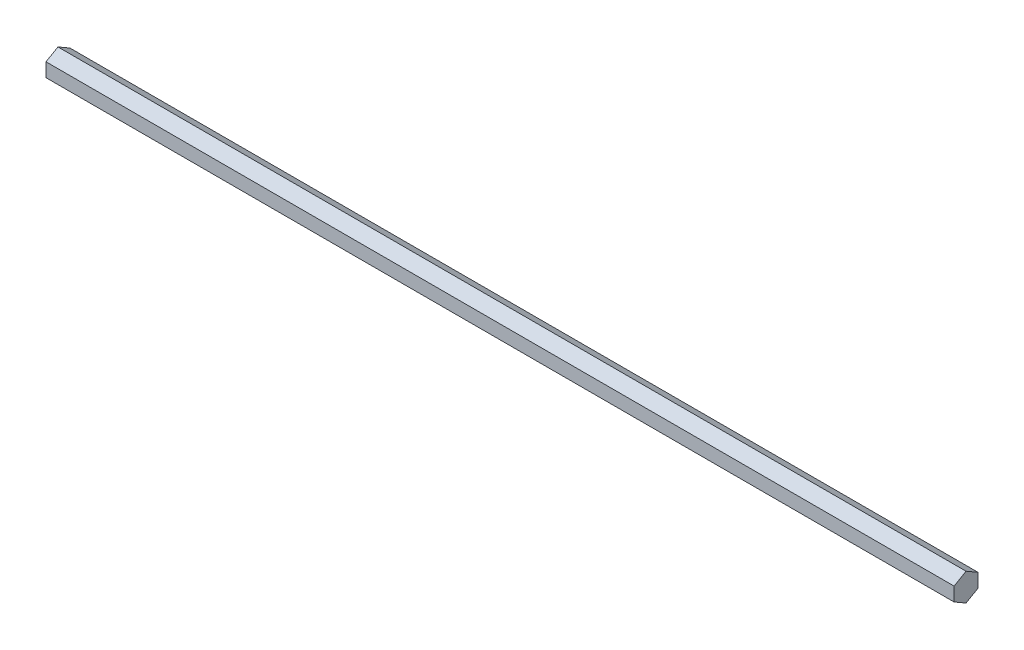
from build123d import *

# Parameters (mm, degrees)
BOSS_EXTRU_1_DEPTH = 100


with BuildPart() as part:
    # Esquisse1 → Boss.-Extru.1 (new body)
    with BuildSketch(Plane(origin=(0, 0, 0), x_dir=(0, 0, -1), z_dir=(1, 0, 0))):
        Polygon((0, 1.518431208), (-1.315, 0.759215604), (-1.315, -0.759215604), (0, -1.518431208), (1.315, -0.759215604), (1.315, 0.759215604), align=None)
    extrude(amount=BOSS_EXTRU_1_DEPTH)


solid = part.part
